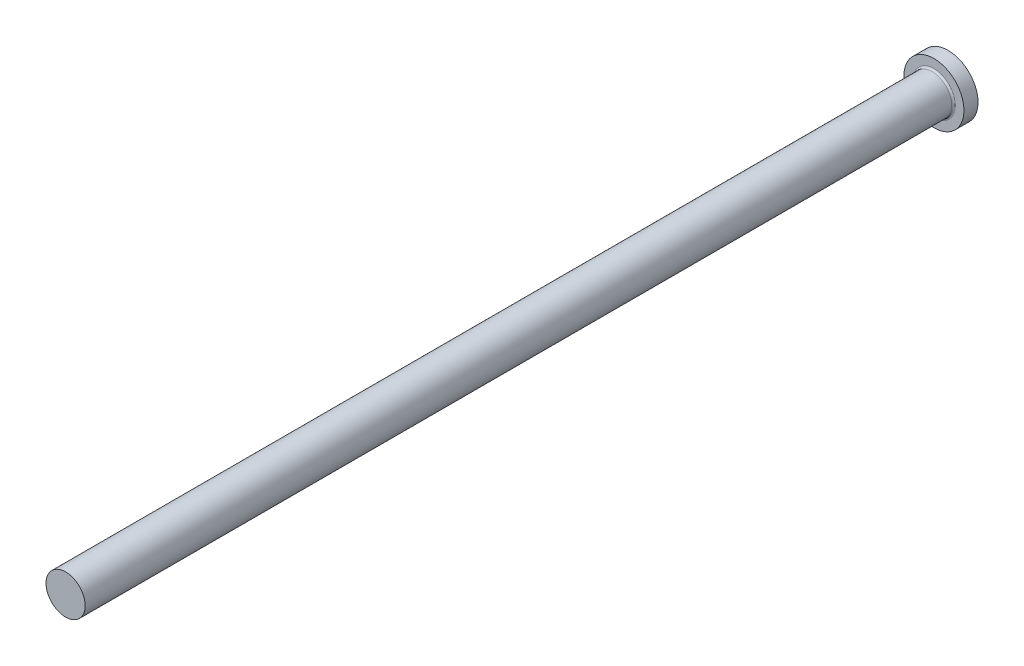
from build123d import *

# Parameters (mm, degrees)
FILLET1_R = 0.5


with BuildPart() as part:
    # FV → Revolve1 (revolve)
    with BuildSketch(Plane(origin=(0, 0, 0), x_dir=(1, 0, 0), z_dir=(0, 1, 0)), mode=Mode.PRIVATE) as revolve1_sk:
        Polygon((0, 0), (8.5, 0), (8.5, -4), (5.55, -4), (5.55, -250), (0, -250), align=None)
    revolve(revolve1_sk.sketch.rotate(Axis((0, 0, -9.033228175), (0, 0, 1)), 180), axis=Axis((0, 0, -9.033228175), (0, 0, 1)))

    # Fillet1
    fillet1_edges = [part.edges().sort_by_distance(p)[0] for p in [
        (5.55, 0, 4),
    ]]
    fillet(fillet1_edges, radius=FILLET1_R)


solid = part.part
